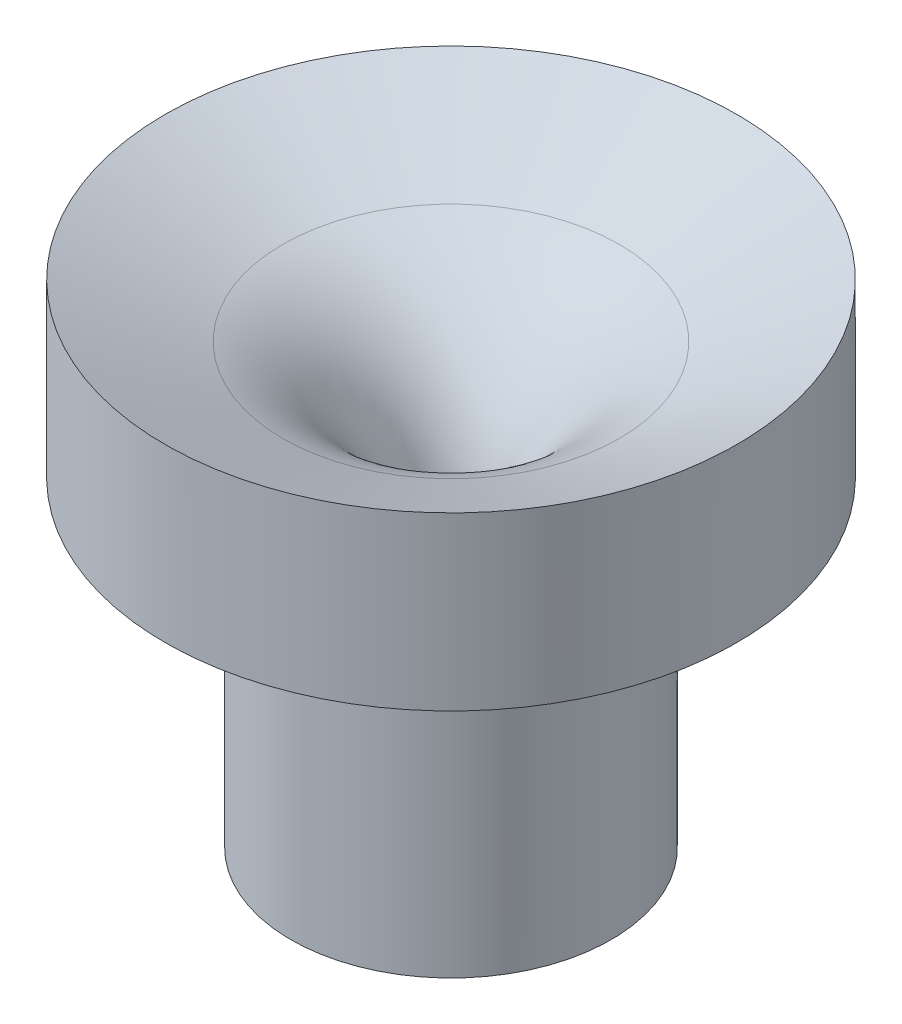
ISO-10303-21;
HEADER;
FILE_DESCRIPTION(('STEP AP214'),'2;1');
FILE_NAME('part.step','',(''),(''),'','','');
FILE_SCHEMA(('AUTOMOTIVE_DESIGN { 1 0 10303 214 1 1 1 1 }'));
ENDSEC;
DATA;
#1=APPLICATION_CONTEXT('core data for automotive mechanical design processes');
#2=APPLICATION_PROTOCOL_DEFINITION('international standard','automotive_design',2000,#1);
#3=PRODUCT_CONTEXT('',#1,'mechanical');
#4=PRODUCT('Part','Part','',(#3));
#5=PRODUCT_RELATED_PRODUCT_CATEGORY('part','',(#4));
#6=PRODUCT_DEFINITION_FORMATION('','',#4);
#7=PRODUCT_DEFINITION_CONTEXT('part definition',#1,'design');
#8=PRODUCT_DEFINITION('design','',#6,#7);
#9=PRODUCT_DEFINITION_SHAPE('','',#8);
#10=(LENGTH_UNIT() NAMED_UNIT(*) SI_UNIT(.MILLI.,.METRE.));
#11=(NAMED_UNIT(*) PLANE_ANGLE_UNIT() SI_UNIT($,.RADIAN.));
#12=(NAMED_UNIT(*) SI_UNIT($,.STERADIAN.) SOLID_ANGLE_UNIT());
#13=UNCERTAINTY_MEASURE_WITH_UNIT(LENGTH_MEASURE(1.E-05),#10,'distance_accuracy_value','');
#14=(GEOMETRIC_REPRESENTATION_CONTEXT(3) GLOBAL_UNCERTAINTY_ASSIGNED_CONTEXT((#13)) GLOBAL_UNIT_ASSIGNED_CONTEXT((#10,
#11,#12)) REPRESENTATION_CONTEXT('',''));
#15=CARTESIAN_POINT('',(0.,0.,0.));
#16=DIRECTION('',(0.,0.,1.));
#17=DIRECTION('',(1.,0.,0.));
#18=AXIS2_PLACEMENT_3D('',#15,#16,#17);
#19=CARTESIAN_POINT('',(19.3037373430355,50.0443452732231,0.));
#20=DIRECTION('',(0.,1.,0.));
#21=DIRECTION('',(-1.,0.,0.));
#22=AXIS2_PLACEMENT_3D('',#19,#20,#21);
#23=CONICAL_SURFACE('',#22,1.49999999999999,1.14316613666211);
#24=CARTESIAN_POINT('',(19.3037373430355,52.7118134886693,0.));
#25=DIRECTION('',(0.,-1.,0.));
#26=DIRECTION('',(1.,0.,0.));
#27=AXIS2_PLACEMENT_3D('',#24,#25,#26);
#28=CIRCLE('',#27,7.35284442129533);
#29=CARTESIAN_POINT('',(26.6565817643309,52.7118134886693,0.));
#30=VERTEX_POINT('',#29);
#31=EDGE_CURVE('E10',#30,#30,#28,.T.);
#32=ORIENTED_EDGE('',*,*,#31,.T.);
#33=EDGE_LOOP('',(#32));
#34=FACE_BOUND('',#33,.T.);
#35=CARTESIAN_POINT('',(19.3037373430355,55.0576598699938,0.));
#36=DIRECTION('',(0.,1.,0.));
#37=DIRECTION('',(-1.,0.,0.));
#38=AXIS2_PLACEMENT_3D('',#35,#36,#37);
#39=CIRCLE('',#38,12.5);
#40=CARTESIAN_POINT('',(6.80373734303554,55.0576598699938,0.));
#41=VERTEX_POINT('',#40);
#42=EDGE_CURVE('E60',#41,#41,#39,.T.);
#43=ORIENTED_EDGE('',*,*,#42,.T.);
#44=EDGE_LOOP('',(#43));
#45=FACE_BOUND('',#44,.T.);
#46=ADVANCED_FACE('F31',(#34,#45),#23,.F.);
#47=CARTESIAN_POINT('',(19.3037373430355,57.2842333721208,0.));
#48=DIRECTION('',(0.,1.,0.));
#49=DIRECTION('',(-1.,0.,0.));
#50=AXIS2_PLACEMENT_3D('',#47,#48,#49);
#51=CYLINDRICAL_SURFACE('',#50,1.5);
#52=CARTESIAN_POINT('',(19.3037373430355,43.6123024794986,0.));
#53=DIRECTION('',(0.,-1.,0.));
#54=DIRECTION('',(1.,0.,0.));
#55=AXIS2_PLACEMENT_3D('',#52,#53,#54);
#56=CIRCLE('',#55,1.5);
#57=CARTESIAN_POINT('',(20.8037373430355,43.6123024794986,0.));
#58=VERTEX_POINT('',#57);
#59=EDGE_CURVE('E38',#58,#58,#56,.F.);
#60=ORIENTED_EDGE('',*,*,#59,.T.);
#61=EDGE_LOOP('',(#60));
#62=FACE_BOUND('',#61,.T.);
#63=CARTESIAN_POINT('',(19.3037373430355,37.5576598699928,0.));
#64=DIRECTION('',(0.,1.,0.));
#65=DIRECTION('',(-1.,0.,0.));
#66=AXIS2_PLACEMENT_3D('',#63,#64,#65);
#67=CIRCLE('',#66,1.5);
#68=CARTESIAN_POINT('',(17.8037373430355,37.5576598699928,0.));
#69=VERTEX_POINT('',#68);
#70=EDGE_CURVE('E51',#69,#69,#67,.T.);
#71=ORIENTED_EDGE('',*,*,#70,.F.);
#72=EDGE_LOOP('',(#71));
#73=FACE_BOUND('',#72,.T.);
#74=ADVANCED_FACE('F84',(#62,#73),#51,.F.);
#75=CARTESIAN_POINT('',(19.3037373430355,33.5576598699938,0.));
#76=DIRECTION('',(0.,-1.,0.));
#77=DIRECTION('',(1.,0.,0.));
#78=AXIS2_PLACEMENT_3D('',#75,#76,#77);
#79=CONICAL_SURFACE('',#78,2.5,0.244978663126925);
#80=ORIENTED_EDGE('',*,*,#70,.T.);
#81=EDGE_LOOP('',(#80));
#82=FACE_BOUND('',#81,.T.);
#83=CARTESIAN_POINT('',(19.3037373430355,33.5576598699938,0.));
#84=DIRECTION('',(0.,1.,0.));
#85=DIRECTION('',(-1.,0.,0.));
#86=AXIS2_PLACEMENT_3D('',#83,#84,#85);
#87=CIRCLE('',#86,2.5);
#88=CARTESIAN_POINT('',(16.8037373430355,33.5576598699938,0.));
#89=VERTEX_POINT('',#88);
#90=EDGE_CURVE('E54',#89,#89,#87,.T.);
#91=ORIENTED_EDGE('',*,*,#90,.F.);
#92=EDGE_LOOP('',(#91));
#93=FACE_BOUND('',#92,.T.);
#94=ADVANCED_FACE('F89',(#82,#93),#79,.F.);
#95=CARTESIAN_POINT('',(12.3037373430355,33.5576598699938,0.));
#96=DIRECTION('',(0.,-1.,0.));
#97=DIRECTION('',(1.,0.,0.));
#98=AXIS2_PLACEMENT_3D('',#95,#96,#97);
#99=PLANE('',#98);
#100=ORIENTED_EDGE('',*,*,#90,.T.);
#101=EDGE_LOOP('',(#100));
#102=FACE_BOUND('',#101,.T.);
#103=CARTESIAN_POINT('',(19.3037373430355,33.5576598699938,0.));
#104=DIRECTION('',(0.,1.,0.));
#105=DIRECTION('',(-1.,0.,0.));
#106=AXIS2_PLACEMENT_3D('',#103,#104,#105);
#107=CIRCLE('',#106,7.);
#108=CARTESIAN_POINT('',(12.3037373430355,33.5576598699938,0.));
#109=VERTEX_POINT('',#108);
#110=EDGE_CURVE('E57',#109,#109,#107,.T.);
#111=ORIENTED_EDGE('',*,*,#110,.F.);
#112=EDGE_LOOP('',(#111));
#113=FACE_BOUND('',#112,.T.);
#114=ADVANCED_FACE('F95',(#102,#113),#99,.T.);
#115=CARTESIAN_POINT('',(19.3037373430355,57.2842333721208,0.));
#116=DIRECTION('',(0.,1.,0.));
#117=DIRECTION('',(-1.,0.,0.));
#118=AXIS2_PLACEMENT_3D('',#115,#116,#117);
#119=CYLINDRICAL_SURFACE('',#118,7.);
#120=CARTESIAN_POINT('',(19.3037373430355,45.5576598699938,0.));
#121=DIRECTION('',(0.,-1.,0.));
#122=DIRECTION('',(0.,0.,-1.));
#123=AXIS2_PLACEMENT_3D('',#120,#121,#122);
#124=CIRCLE('',#123,7.);
#125=CARTESIAN_POINT('',(19.3037373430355,45.5576598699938,-7.));
#126=VERTEX_POINT('',#125);
#127=EDGE_CURVE('E42',#126,#126,#124,.T.);
#128=ORIENTED_EDGE('',*,*,#127,.T.);
#129=EDGE_LOOP('',(#128));
#130=FACE_BOUND('',#129,.T.);
#131=ORIENTED_EDGE('',*,*,#110,.T.);
#132=EDGE_LOOP('',(#131));
#133=FACE_BOUND('',#132,.T.);
#134=ADVANCED_FACE('F79',(#130,#133),#119,.T.);
#135=CARTESIAN_POINT('',(8.30373734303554,47.5576598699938,0.));
#136=DIRECTION('',(0.,-1.,0.));
#137=DIRECTION('',(1.,0.,0.));
#138=AXIS2_PLACEMENT_3D('',#135,#136,#137);
#139=PLANE('',#138);
#140=CARTESIAN_POINT('',(19.3037373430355,47.5576598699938,0.));
#141=DIRECTION('',(0.,-1.,0.));
#142=DIRECTION('',(1.,0.,0.));
#143=AXIS2_PLACEMENT_3D('',#140,#141,#142);
#144=CIRCLE('',#143,9.00000000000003);
#145=CARTESIAN_POINT('',(28.3037373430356,47.5576598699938,0.));
#146=VERTEX_POINT('',#145);
#147=EDGE_CURVE('E46',#146,#146,#144,.F.);
#148=ORIENTED_EDGE('',*,*,#147,.T.);
#149=EDGE_LOOP('',(#148));
#150=FACE_BOUND('',#149,.T.);
#151=CARTESIAN_POINT('',(19.3037373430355,47.5576598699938,0.));
#152=DIRECTION('',(0.,-1.,0.));
#153=DIRECTION('',(0.,0.,-1.));
#154=AXIS2_PLACEMENT_3D('',#151,#152,#153);
#155=CIRCLE('',#154,12.5);
#156=CARTESIAN_POINT('',(19.3037373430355,47.5576598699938,-12.5));
#157=VERTEX_POINT('',#156);
#158=EDGE_CURVE('E63',#157,#157,#155,.T.);
#159=ORIENTED_EDGE('',*,*,#158,.T.);
#160=EDGE_LOOP('',(#159));
#161=FACE_BOUND('',#160,.T.);
#162=ADVANCED_FACE('F67',(#150,#161),#139,.T.);
#163=CARTESIAN_POINT('',(19.3037373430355,57.2842333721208,0.));
#164=DIRECTION('',(0.,1.,0.));
#165=DIRECTION('',(-1.,0.,0.));
#166=AXIS2_PLACEMENT_3D('',#163,#164,#165);
#167=CYLINDRICAL_SURFACE('',#166,12.5);
#168=ORIENTED_EDGE('',*,*,#42,.F.);
#169=EDGE_LOOP('',(#168));
#170=FACE_BOUND('',#169,.T.);
#171=ORIENTED_EDGE('',*,*,#158,.F.);
#172=EDGE_LOOP('',(#171));
#173=FACE_BOUND('',#172,.T.);
#174=ADVANCED_FACE('F69',(#170,#173),#167,.T.);
#175=CARTESIAN_POINT('',(19.3037373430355,47.5576598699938,0.));
#176=DIRECTION('',(0.,1.,0.));
#177=DIRECTION('',(0.,0.,1.));
#178=AXIS2_PLACEMENT_3D('',#175,#176,#177);
#179=CONICAL_SURFACE('',#178,9.00000000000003,0.785398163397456);
#180=ORIENTED_EDGE('',*,*,#127,.F.);
#181=EDGE_LOOP('',(#180));
#182=FACE_BOUND('',#181,.T.);
#183=ORIENTED_EDGE('',*,*,#147,.F.);
#184=EDGE_LOOP('',(#183));
#185=FACE_BOUND('',#184,.T.);
#186=ADVANCED_FACE('F71',(#182,#185),#179,.T.);
#187=CARTESIAN_POINT('',(19.3037373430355,43.6123024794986,0.));
#188=DIRECTION('',(0.,-1.,0.));
#189=DIRECTION('',(1.,0.,0.));
#190=AXIS2_PLACEMENT_3D('',#187,#188,#189);
#191=TOROIDAL_SURFACE('',#190,11.5,10.);
#192=ORIENTED_EDGE('',*,*,#31,.F.);
#193=EDGE_LOOP('',(#192));
#194=FACE_BOUND('',#193,.T.);
#195=ORIENTED_EDGE('',*,*,#59,.F.);
#196=EDGE_LOOP('',(#195));
#197=FACE_BOUND('',#196,.T.);
#198=ADVANCED_FACE('F33',(#194,#197),#191,.T.);
#199=CLOSED_SHELL('',(#46,#74,#94,#114,#134,#162,#174,#186,#198));
#200=MANIFOLD_SOLID_BREP('B2',#199);
#201=ADVANCED_BREP_SHAPE_REPRESENTATION('',(#18,#200),#14);
#202=SHAPE_DEFINITION_REPRESENTATION(#9,#201);
ENDSEC;
END-ISO-10303-21;
